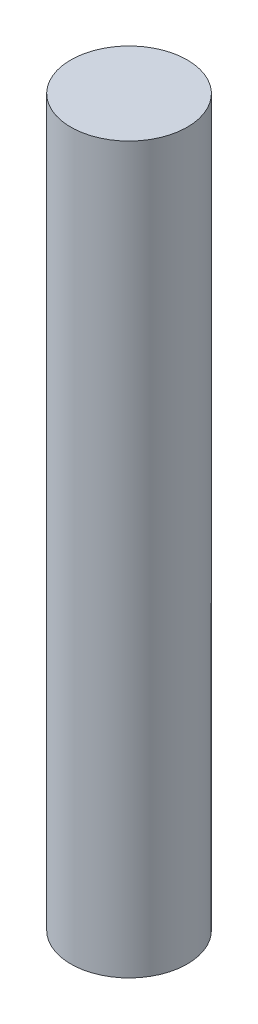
from build123d import *

# Parameters (mm, degrees)
ESQUISSE2_W = 2
ESQUISSE2_H = 24.880764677


with BuildPart() as part:
    # Esquisse2 → R_volution1 (revolve)
    with BuildSketch(Plane(origin=(0, 0, 0), x_dir=(0, 0, -1), z_dir=(1, 0, 0)), mode=Mode.PRIVATE) as r_volution1_sk:
        with Locations((138, -137.522947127)):
            Rectangle(ESQUISSE2_W, ESQUISSE2_H)
    revolve(r_volution1_sk.sketch.rotate(Axis((0, -172.219437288, -139), (0, 1, 0)), 180), axis=Axis((0, -172.219437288, -139), (0, 1, 0)))


solid = part.part
